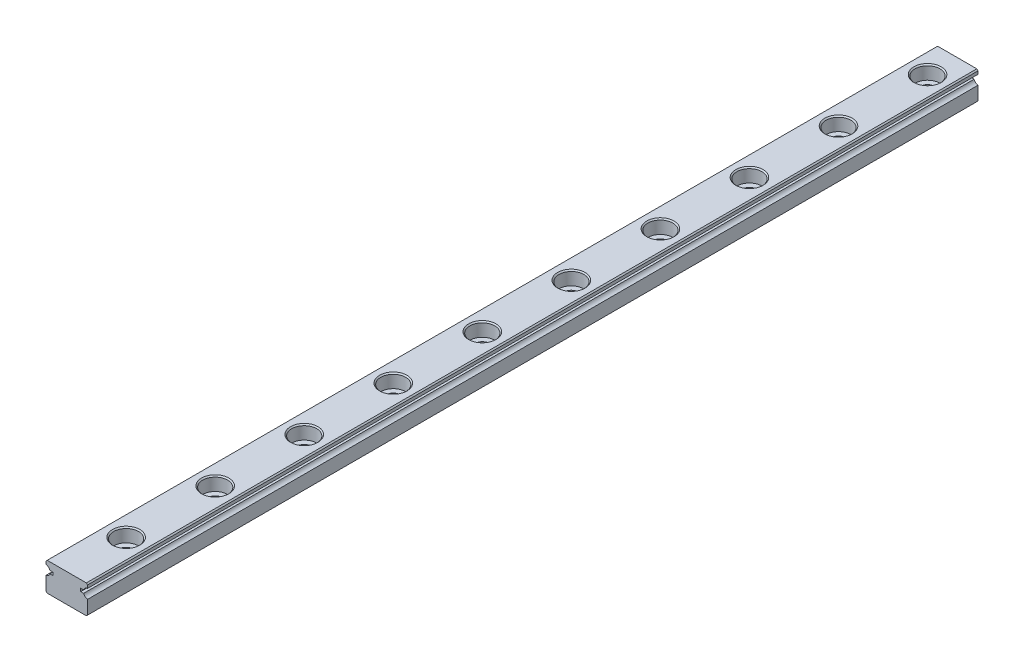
from build123d import *

# Parameters (mm, degrees)
EXTRUDE1_DEPTH             = 150
EXTRUDE2_REACH             = 152.118
SKETCH2_R                  = 1.2
SKETCH_R                   = 2.1
SKETCH_R_2                 = 1.2
EXTRUDE4_DEPTH             = 2.3
CHAMFER1_SIZE              = 0.2
LPATTERN1_COUNT            = 10
LPATTERN1_PITCH            = 15
CHAMFER1_OF_LPATTERN1_SIZE = 0.2


with BuildPart() as part:
    # Sketch1 → Extrude1 (new body)
    with BuildSketch(Plane.XY):
        with BuildLine():
            Line((-3.3, -2.4), (3.3, -2.4))
            Line((3.3, -2.4), (3.5, -2.2))
            Line((3.5, -2.2), (3.5, 0.106274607))
            ThreePointArc((3.5, 0.106274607), (3.091294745, 0.282570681), (2.840065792, 0.65))
            Line((2.840065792, 0.65), (2.340065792, 0.65))
            Line((2.340065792, 0.65), (2.340065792, 1.15))
            Line((2.340065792, 1.15), (2.840065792, 1.15))
            ThreePointArc((2.840065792, 1.15), (3.091294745, 1.517429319), (3.5, 1.693725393))
            Line((3.5, 1.693725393), (3.5, 2.2))
            Line((3.5, 2.2), (3.3, 2.4))
            Line((3.3, 2.4), (-3.3, 2.4))
            Line((-3.3, 2.4), (-3.5, 2.2))
            Line((-3.5, 2.2), (-3.5, 1.693725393))
            ThreePointArc((-3.5, 1.693725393), (-3.091294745, 1.517429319), (-2.840065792, 1.15))
            Line((-2.840065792, 1.15), (-2.340065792, 1.15))
            Line((-2.340065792, 1.15), (-2.340065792, 0.65))
            Line((-2.340065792, 0.65), (-2.840065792, 0.65))
            ThreePointArc((-2.840065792, 0.65), (-3.091294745, 0.282570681), (-3.5, 0.106274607))
            Line((-3.5, 0.106274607), (-3.5, -2.2))
            Line((-3.5, -2.2), (-3.3, -2.4))
        make_face()
    extrude(amount=EXTRUDE1_DEPTH)

    # Sketch2 → Extrude2 (cut, up to next)
    with BuildSketch(Plane(origin=(0, 2.4, 0), x_dir=(1, 0, 0), z_dir=(0, 1, 0)), mode=Mode.PRIVATE) as extrude2_sk1:
        with Locations(Location((0, -5, 0), (0, 0, 270))):
            Circle(SKETCH2_R)
    extrude2_tool1 = extrude(extrude2_sk1.sketch, amount=-EXTRUDE2_REACH, mode=Mode.PRIVATE) & part.part
    extrude2 = extrude2_tool1.solids().sort_by_distance((0, 2.4, 5))[0]
    add(extrude2, mode=Mode.SUBTRACT)

    # Sketch → Extrude4 (cut)
    with BuildSketch(Plane(origin=(0, 2.4, 0), x_dir=(1, 0, 0), z_dir=(0, 1, 0))):
        with Locations(Location((0, -5, 0), (0, 0, 270))):
            Circle(SKETCH_R)
        with Locations(Location((0, -5, 0), (0, 0, 270))):
            Circle(SKETCH_R_2, mode=Mode.SUBTRACT)
    extrude4 = extrude(amount=-EXTRUDE4_DEPTH, mode=Mode.SUBTRACT)

    # Chamfer1
    chamfer1_edges = [part.edges().sort_by_distance(p)[0] for p in [
        (0, -2.4, 3.8),
        (0, 2.4, 2.9),
    ]]
    chamfer(chamfer1_edges, length=CHAMFER1_SIZE)

    # LPattern1: Extrude2, Extrude4 ×10
    with Locations(*[(0, 0, i * LPATTERN1_PITCH) for i in range(1, LPATTERN1_COUNT)]):
        add(extrude2, mode=Mode.SUBTRACT)
        add(extrude4, mode=Mode.SUBTRACT)

    # Chamfer1 of LPattern1
    chamfer1_of_lpattern1_edges = [part.edges().sort_by_distance(p)[0] for p in [
        (0, -2.4, 18.8),
        (0, 2.4, 17.9),
        (0, -2.4, 33.8),
        (0, 2.4, 32.9),
        (0, -2.4, 48.8),
        (0, 2.4, 47.9),
        (0, -2.4, 63.8),
        (0, 2.4, 62.9),
        (0, -2.4, 78.8),
        (0, 2.4, 77.9),
        (0, -2.4, 93.8),
        (0, 2.4, 92.9),
        (0, -2.4, 108.8),
        (0, 2.4, 107.9),
        (0, -2.4, 123.8),
        (0, 2.4, 122.9),
        (0, -2.4, 138.8),
        (0, 2.4, 137.9),
    ]]
    chamfer(chamfer1_of_lpattern1_edges, length=CHAMFER1_OF_LPATTERN1_SIZE)


solid = part.part
